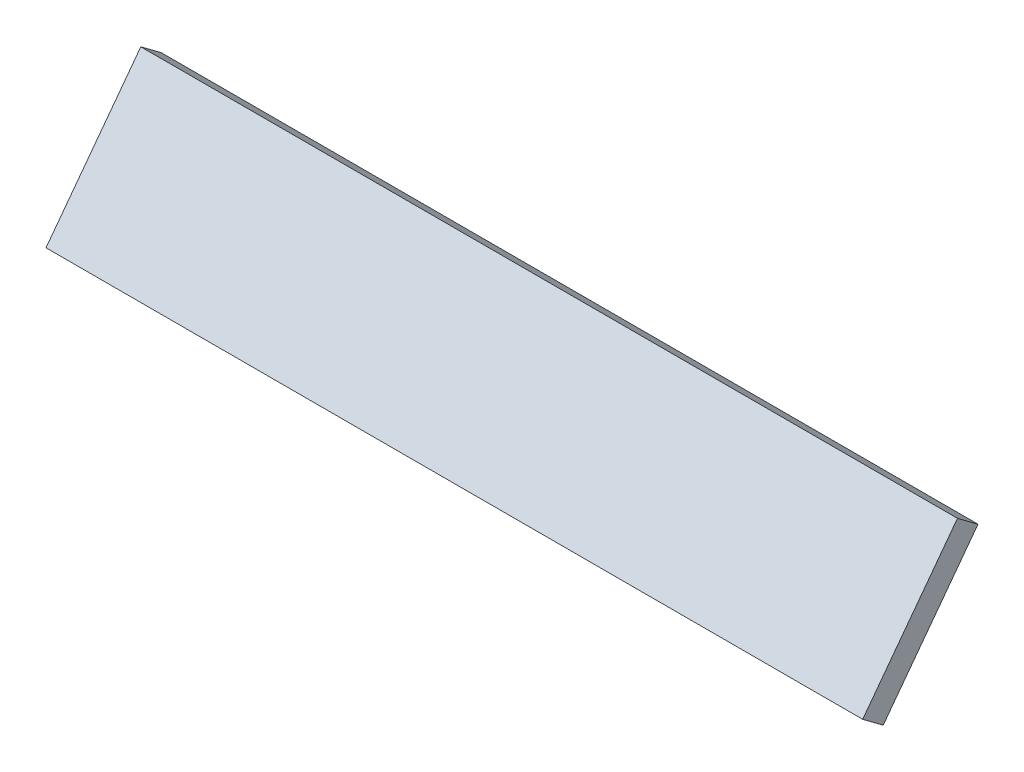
from build123d import *

# Parameters (mm, degrees)
BOSS_EXTRUDE1_DEPTH = 38.1


with BuildPart() as part:
    # 3DSketch1 → Boss-Extrude1 (new body)
    with BuildSketch(Plane(origin=(-406.4, -2478.566619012, 140.756251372), x_dir=(0.981748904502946, 0.15227499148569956, -0.11393601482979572), z_dir=(-2.012437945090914e-15, -0.5990902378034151, -0.8006815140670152))):
        Polygon((0, 0), (1190.714158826, 230.661905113), (1235.397355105, 0), (44.683196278, -230.661905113), align=None)
    extrude(amount=-BOSS_EXTRUDE1_DEPTH)


solid = part.part
